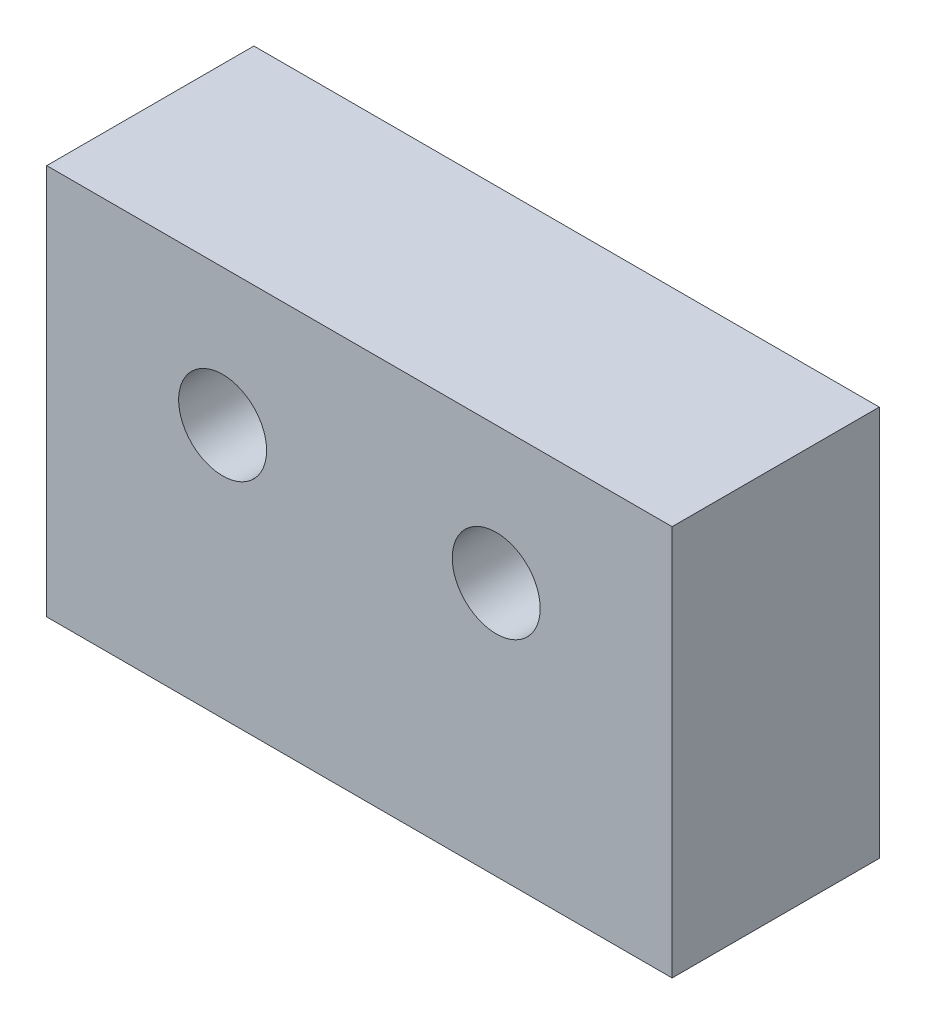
ISO-10303-21;
HEADER;
FILE_DESCRIPTION(('STEP AP214'),'2;1');
FILE_NAME('part.step','',(''),(''),'','','');
FILE_SCHEMA(('AUTOMOTIVE_DESIGN { 1 0 10303 214 1 1 1 1 }'));
ENDSEC;
DATA;
#1=APPLICATION_CONTEXT('core data for automotive mechanical design processes');
#2=APPLICATION_PROTOCOL_DEFINITION('international standard','automotive_design',2000,#1);
#3=PRODUCT_CONTEXT('',#1,'mechanical');
#4=PRODUCT('Part','Part','',(#3));
#5=PRODUCT_RELATED_PRODUCT_CATEGORY('part','',(#4));
#6=PRODUCT_DEFINITION_FORMATION('','',#4);
#7=PRODUCT_DEFINITION_CONTEXT('part definition',#1,'design');
#8=PRODUCT_DEFINITION('design','',#6,#7);
#9=PRODUCT_DEFINITION_SHAPE('','',#8);
#10=(LENGTH_UNIT() NAMED_UNIT(*) SI_UNIT(.MILLI.,.METRE.));
#11=(NAMED_UNIT(*) PLANE_ANGLE_UNIT() SI_UNIT($,.RADIAN.));
#12=(NAMED_UNIT(*) SI_UNIT($,.STERADIAN.) SOLID_ANGLE_UNIT());
#13=UNCERTAINTY_MEASURE_WITH_UNIT(LENGTH_MEASURE(1.E-05),#10,'distance_accuracy_value','');
#14=(GEOMETRIC_REPRESENTATION_CONTEXT(3) GLOBAL_UNCERTAINTY_ASSIGNED_CONTEXT((#13)) GLOBAL_UNIT_ASSIGNED_CONTEXT((#10,
#11,#12)) REPRESENTATION_CONTEXT('',''));
#15=CARTESIAN_POINT('',(0.,0.,0.));
#16=DIRECTION('',(0.,0.,1.));
#17=DIRECTION('',(1.,0.,0.));
#18=AXIS2_PLACEMENT_3D('',#15,#16,#17);
#19=CARTESIAN_POINT('',(0.,0.,10.6));
#20=DIRECTION('',(0.,0.,-1.));
#21=DIRECTION('',(-1.,0.,0.));
#22=AXIS2_PLACEMENT_3D('',#19,#20,#21);
#23=PLANE('',#22);
#24=CARTESIAN_POINT('',(9.,-7.,10.6));
#25=DIRECTION('',(0.,0.,1.));
#26=DIRECTION('',(1.,0.,0.));
#27=AXIS2_PLACEMENT_3D('',#24,#25,#26);
#28=CIRCLE('',#27,2.25);
#29=CARTESIAN_POINT('',(11.25,-7.,10.6));
#30=VERTEX_POINT('',#29);
#31=EDGE_CURVE('E99',#30,#30,#28,.T.);
#32=ORIENTED_EDGE('',*,*,#31,.F.);
#33=EDGE_LOOP('',(#32));
#34=FACE_BOUND('',#33,.T.);
#35=DIRECTION('',(0.,-1.,0.));
#36=VECTOR('',#35,1.);
#37=CARTESIAN_POINT('',(0.,-20.,10.6));
#38=LINE('',#37,#36);
#39=CARTESIAN_POINT('',(0.,0.,10.6));
#40=VERTEX_POINT('',#39);
#41=CARTESIAN_POINT('',(0.,-20.,10.6));
#42=VERTEX_POINT('',#41);
#43=EDGE_CURVE('E84',#40,#42,#38,.T.);
#44=ORIENTED_EDGE('',*,*,#43,.T.);
#45=DIRECTION('',(1.,0.,0.));
#46=VECTOR('',#45,1.);
#47=CARTESIAN_POINT('',(0.,-20.,10.6));
#48=LINE('',#47,#46);
#49=CARTESIAN_POINT('',(32.,-20.,10.6));
#50=VERTEX_POINT('',#49);
#51=EDGE_CURVE('E79',#42,#50,#48,.T.);
#52=ORIENTED_EDGE('',*,*,#51,.T.);
#53=DIRECTION('',(0.,1.,0.));
#54=VECTOR('',#53,1.);
#55=CARTESIAN_POINT('',(32.,-20.,10.6));
#56=LINE('',#55,#54);
#57=CARTESIAN_POINT('',(32.,0.,10.6));
#58=VERTEX_POINT('',#57);
#59=EDGE_CURVE('E82',#50,#58,#56,.T.);
#60=ORIENTED_EDGE('',*,*,#59,.T.);
#61=DIRECTION('',(-1.,0.,0.));
#62=VECTOR('',#61,1.);
#63=CARTESIAN_POINT('',(0.,0.,10.6));
#64=LINE('',#63,#62);
#65=EDGE_CURVE('E49',#58,#40,#64,.T.);
#66=ORIENTED_EDGE('',*,*,#65,.T.);
#67=EDGE_LOOP('',(#44,#52,#60,#66));
#68=FACE_BOUND('',#67,.T.);
#69=CARTESIAN_POINT('',(23.,-7.,10.6));
#70=DIRECTION('',(0.,0.,1.));
#71=DIRECTION('',(1.,0.,0.));
#72=AXIS2_PLACEMENT_3D('',#69,#70,#71);
#73=CIRCLE('',#72,2.25);
#74=CARTESIAN_POINT('',(25.25,-7.,10.6));
#75=VERTEX_POINT('',#74);
#76=EDGE_CURVE('E114',#75,#75,#73,.T.);
#77=ORIENTED_EDGE('',*,*,#76,.F.);
#78=EDGE_LOOP('',(#77));
#79=FACE_BOUND('',#78,.T.);
#80=ADVANCED_FACE('F32',(#34,#68,#79),#23,.F.);
#81=CARTESIAN_POINT('',(0.,0.,0.));
#82=DIRECTION('',(0.,0.,-1.));
#83=DIRECTION('',(-1.,0.,0.));
#84=AXIS2_PLACEMENT_3D('',#81,#82,#83);
#85=PLANE('',#84);
#86=CARTESIAN_POINT('',(9.,-7.,0.));
#87=DIRECTION('',(0.,0.,1.));
#88=DIRECTION('',(1.,0.,0.));
#89=AXIS2_PLACEMENT_3D('',#86,#87,#88);
#90=CIRCLE('',#89,2.25);
#91=CARTESIAN_POINT('',(11.25,-7.,0.));
#92=VERTEX_POINT('',#91);
#93=EDGE_CURVE('E111',#92,#92,#90,.T.);
#94=ORIENTED_EDGE('',*,*,#93,.T.);
#95=EDGE_LOOP('',(#94));
#96=FACE_BOUND('',#95,.T.);
#97=DIRECTION('',(0.,-1.,0.));
#98=VECTOR('',#97,1.);
#99=CARTESIAN_POINT('',(0.,-20.,0.));
#100=LINE('',#99,#98);
#101=CARTESIAN_POINT('',(0.,0.,0.));
#102=VERTEX_POINT('',#101);
#103=CARTESIAN_POINT('',(0.,-20.,0.));
#104=VERTEX_POINT('',#103);
#105=EDGE_CURVE('E96',#102,#104,#100,.T.);
#106=ORIENTED_EDGE('',*,*,#105,.F.);
#107=DIRECTION('',(-1.,0.,0.));
#108=VECTOR('',#107,1.);
#109=CARTESIAN_POINT('',(0.,0.,0.));
#110=LINE('',#109,#108);
#111=CARTESIAN_POINT('',(32.,0.,0.));
#112=VERTEX_POINT('',#111);
#113=EDGE_CURVE('E72',#112,#102,#110,.T.);
#114=ORIENTED_EDGE('',*,*,#113,.F.);
#115=DIRECTION('',(0.,1.,0.));
#116=VECTOR('',#115,1.);
#117=CARTESIAN_POINT('',(32.,-20.,0.));
#118=LINE('',#117,#116);
#119=CARTESIAN_POINT('',(32.,-20.,0.));
#120=VERTEX_POINT('',#119);
#121=EDGE_CURVE('E66',#120,#112,#118,.T.);
#122=ORIENTED_EDGE('',*,*,#121,.F.);
#123=DIRECTION('',(1.,0.,0.));
#124=VECTOR('',#123,1.);
#125=CARTESIAN_POINT('',(0.,-20.,0.));
#126=LINE('',#125,#124);
#127=EDGE_CURVE('E88',#104,#120,#126,.T.);
#128=ORIENTED_EDGE('',*,*,#127,.F.);
#129=EDGE_LOOP('',(#106,#114,#122,#128));
#130=FACE_BOUND('',#129,.T.);
#131=CARTESIAN_POINT('',(23.,-7.,0.));
#132=DIRECTION('',(0.,0.,1.));
#133=DIRECTION('',(1.,0.,0.));
#134=AXIS2_PLACEMENT_3D('',#131,#132,#133);
#135=CIRCLE('',#134,2.25);
#136=CARTESIAN_POINT('',(25.25,-7.,0.));
#137=VERTEX_POINT('',#136);
#138=EDGE_CURVE('E117',#137,#137,#135,.T.);
#139=ORIENTED_EDGE('',*,*,#138,.T.);
#140=EDGE_LOOP('',(#139));
#141=FACE_BOUND('',#140,.T.);
#142=ADVANCED_FACE('F107',(#96,#130,#141),#85,.T.);
#143=CARTESIAN_POINT('',(0.,-20.,10.6));
#144=DIRECTION('',(1.,0.,0.));
#145=DIRECTION('',(0.,0.,-1.));
#146=AXIS2_PLACEMENT_3D('',#143,#144,#145);
#147=PLANE('',#146);
#148=ORIENTED_EDGE('',*,*,#105,.T.);
#149=DIRECTION('',(0.,0.,-1.));
#150=VECTOR('',#149,1.);
#151=CARTESIAN_POINT('',(0.,-20.,10.6));
#152=LINE('',#151,#150);
#153=EDGE_CURVE('E11',#42,#104,#152,.T.);
#154=ORIENTED_EDGE('',*,*,#153,.F.);
#155=ORIENTED_EDGE('',*,*,#43,.F.);
#156=DIRECTION('',(0.,0.,-1.));
#157=VECTOR('',#156,1.);
#158=CARTESIAN_POINT('',(0.,0.,10.6));
#159=LINE('',#158,#157);
#160=EDGE_CURVE('E92',#40,#102,#159,.T.);
#161=ORIENTED_EDGE('',*,*,#160,.T.);
#162=EDGE_LOOP('',(#148,#154,#155,#161));
#163=FACE_BOUND('',#162,.T.);
#164=ADVANCED_FACE('F34',(#163),#147,.F.);
#165=CARTESIAN_POINT('',(0.,-20.,10.6));
#166=DIRECTION('',(0.,1.,0.));
#167=DIRECTION('',(0.,0.,1.));
#168=AXIS2_PLACEMENT_3D('',#165,#166,#167);
#169=PLANE('',#168);
#170=ORIENTED_EDGE('',*,*,#127,.T.);
#171=DIRECTION('',(0.,0.,-1.));
#172=VECTOR('',#171,1.);
#173=CARTESIAN_POINT('',(32.,-20.,10.6));
#174=LINE('',#173,#172);
#175=EDGE_CURVE('E41',#50,#120,#174,.T.);
#176=ORIENTED_EDGE('',*,*,#175,.F.);
#177=ORIENTED_EDGE('',*,*,#51,.F.);
#178=ORIENTED_EDGE('',*,*,#153,.T.);
#179=EDGE_LOOP('',(#170,#176,#177,#178));
#180=FACE_BOUND('',#179,.T.);
#181=ADVANCED_FACE('F87',(#180),#169,.F.);
#182=CARTESIAN_POINT('',(32.,-20.,10.6));
#183=DIRECTION('',(-1.,0.,0.));
#184=DIRECTION('',(0.,0.,1.));
#185=AXIS2_PLACEMENT_3D('',#182,#183,#184);
#186=PLANE('',#185);
#187=ORIENTED_EDGE('',*,*,#121,.T.);
#188=DIRECTION('',(0.,0.,-1.));
#189=VECTOR('',#188,1.);
#190=CARTESIAN_POINT('',(32.,0.,10.6));
#191=LINE('',#190,#189);
#192=EDGE_CURVE('E89',#58,#112,#191,.T.);
#193=ORIENTED_EDGE('',*,*,#192,.F.);
#194=ORIENTED_EDGE('',*,*,#59,.F.);
#195=ORIENTED_EDGE('',*,*,#175,.T.);
#196=EDGE_LOOP('',(#187,#193,#194,#195));
#197=FACE_BOUND('',#196,.T.);
#198=ADVANCED_FACE('F90',(#197),#186,.F.);
#199=CARTESIAN_POINT('',(0.,0.,10.6));
#200=DIRECTION('',(0.,-1.,0.));
#201=DIRECTION('',(0.,0.,-1.));
#202=AXIS2_PLACEMENT_3D('',#199,#200,#201);
#203=PLANE('',#202);
#204=ORIENTED_EDGE('',*,*,#113,.T.);
#205=ORIENTED_EDGE('',*,*,#160,.F.);
#206=ORIENTED_EDGE('',*,*,#65,.F.);
#207=ORIENTED_EDGE('',*,*,#192,.T.);
#208=EDGE_LOOP('',(#204,#205,#206,#207));
#209=FACE_BOUND('',#208,.T.);
#210=ADVANCED_FACE('F104',(#209),#203,.F.);
#211=CARTESIAN_POINT('',(9.,-7.,10.6));
#212=DIRECTION('',(0.,0.,-1.));
#213=DIRECTION('',(-1.,0.,0.));
#214=AXIS2_PLACEMENT_3D('',#211,#212,#213);
#215=CYLINDRICAL_SURFACE('',#214,2.25);
#216=ORIENTED_EDGE('',*,*,#31,.T.);
#217=EDGE_LOOP('',(#216));
#218=FACE_BOUND('',#217,.T.);
#219=ORIENTED_EDGE('',*,*,#93,.F.);
#220=EDGE_LOOP('',(#219));
#221=FACE_BOUND('',#220,.T.);
#222=ADVANCED_FACE('F135',(#218,#221),#215,.F.);
#223=CARTESIAN_POINT('',(23.,-7.,10.6));
#224=DIRECTION('',(0.,0.,-1.));
#225=DIRECTION('',(-1.,0.,0.));
#226=AXIS2_PLACEMENT_3D('',#223,#224,#225);
#227=CYLINDRICAL_SURFACE('',#226,2.25);
#228=ORIENTED_EDGE('',*,*,#76,.T.);
#229=EDGE_LOOP('',(#228));
#230=FACE_BOUND('',#229,.T.);
#231=ORIENTED_EDGE('',*,*,#138,.F.);
#232=EDGE_LOOP('',(#231));
#233=FACE_BOUND('',#232,.T.);
#234=ADVANCED_FACE('F123',(#230,#233),#227,.F.);
#235=CLOSED_SHELL('',(#80,#142,#164,#181,#198,#210,#222,#234));
#236=MANIFOLD_SOLID_BREP('B2',#235);
#237=ADVANCED_BREP_SHAPE_REPRESENTATION('',(#18,#236),#14);
#238=SHAPE_DEFINITION_REPRESENTATION(#9,#237);
ENDSEC;
END-ISO-10303-21;
